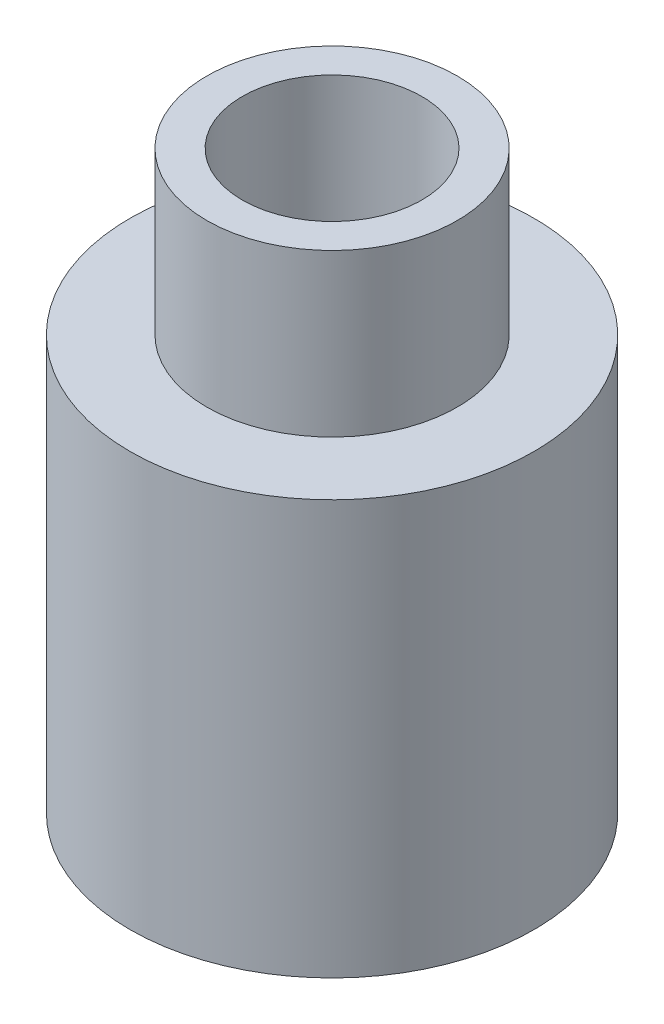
from build123d import *

# Parameters (mm, degrees)
SKETCH3_R                 = 2
BOSS_EXTRUDE2_DEPTH       = 4.1
SKETCH4_R                 = 1.24
BOSS_EXTRUDE3_DEPTH       = 1.6
F_2_56_TAPPED_HOLE1_D     = 1.778
F_2_56_TAPPED_HOLE1_DEPTH = 3.175
F_2_56_TAPPED_HOLE1_TIP   = 0.53416509


with BuildPart() as part:
    # Sketch3 → Boss-Extrude2 (new body)
    with BuildSketch(Plane(origin=(0, 0, 0), x_dir=(1, 0, 0), z_dir=(0, 1, 0))):
        with Locations(Location((0, 0, 0), (0, 0, 270))):
            Circle(SKETCH3_R)
    extrude(amount=BOSS_EXTRUDE2_DEPTH)

    # Sketch4 → Boss-Extrude3 (add)
    with BuildSketch(Plane(origin=(0, 4.1, 0), x_dir=(1, 0, 0), z_dir=(0, 1, 0))):
        with Locations(Location((0, 0, 0), (0, 0, 270))):
            Circle(SKETCH4_R)
    extrude(amount=BOSS_EXTRUDE3_DEPTH)

    # 2-56 Tapped Hole1
    with Locations(Plane(origin=(0, 5.7, 0), x_dir=(1, 0, 0), z_dir=(0, 1, 0))):
        with Locations((0, 0)):
            Hole(F_2_56_TAPPED_HOLE1_D / 2, depth=F_2_56_TAPPED_HOLE1_DEPTH)
            with Locations((0, 0, -(F_2_56_TAPPED_HOLE1_DEPTH + F_2_56_TAPPED_HOLE1_TIP / 2))):  # 118° drill point
                Cone(0, F_2_56_TAPPED_HOLE1_D / 2, F_2_56_TAPPED_HOLE1_TIP, mode=Mode.SUBTRACT)


solid = part.part
